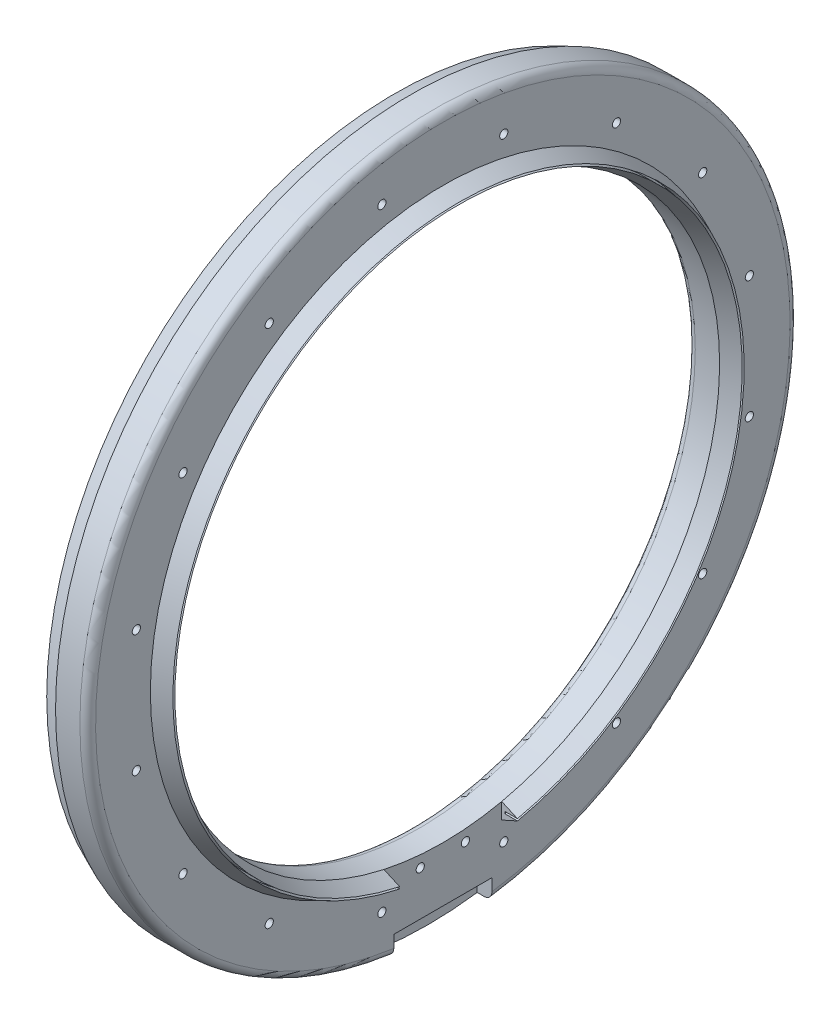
from build123d import *

# Parameters (mm, degrees)
CIRPATTERN4_COUNT               = 16
SKETCH11_W                      = 60
SKETCH11_H                      = 50
CUT_EXTRUDE1_DEPTH              = 10
FILLET4_R                       = 4
CUT_EXTRUDE3_DEPTH              = 25
CUT_EXTRUDE3_DEPTH_BACK         = 25
SKETCH20_W                      = 7.5
SKETCH20_H                      = 12
F_4_40_TAPPED_HOLE1_D           = 2.2606
F_4_40_TAPPED_HOLE1_DEPTH       = 7.6
F_4_40_TAPPED_HOLE1_CBORE_D     = 2.8448
F_4_40_TAPPED_HOLE1_CBORE_DEPTH = 5.69
F_4_40_TAPPED_HOLE1_TIP         = 0.679152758
SKETCH23_W                      = 30
SKETCH23_H                      = 10
BOSS_EXTRUDE2_DEPTH             = 7
SKETCH24_W                      = 30
SKETCH24_H                      = 10
BOSS_EXTRUDE3_DEPTH             = 10
M5X0_8_TAPPED_HOLE4_D           = 4.2
M5X0_8_TAPPED_HOLE4_DEPTH       = 9
M5X0_8_TAPPED_HOLE4_CBORE_D     = 5
M5X0_8_TAPPED_HOLE4_CBORE_DEPTH = 6.5
M5X0_8_TAPPED_HOLE4_TIP         = 1.2618073
SKETCH27_W                      = 2.1
SKETCH27_H                      = 24.4
LPATTERN1_COUNT                 = 2
LPATTERN1_PITCH                 = 23.0124
SKETCH29_W                      = 38.601366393
SKETCH29_H                      = 23.285158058
CUT_EXTRUDE5_DEPTH              = 257.99217901


with BuildPart() as part:
    # Sketch1 → Revolve1 (revolve)
    with BuildSketch(Plane.XY, mode=Mode.PRIVATE) as revolve1_sk:
        Polygon((-8.2, 180.9), (-16.2, 177.4), (-9.8, 177.4), (-9.8, 176.4), (-16.2, 176.4), (-8.2, 172.9), (-8.2, 141), (8.2, 141), (16.2, 144.5), (9.8, 144.5), (9.8, 145.5), (16.2, 145.5), (8.2, 149), (8.2, 180.9), align=None)
    revolve(revolve1_sk.sketch.rotate(Axis((-102.621263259, 0, 0), (1, 0, 0)), 90), axis=Axis((-102.621263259, 0, 0), (1, 0, 0)))

    # Sketch9 → M5x0.8 Tapped Hole2 (revolve, cut)
    with BuildSketch(Plane(origin=(-8.2, 156.14101664, -31.058379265), x_dir=(0, 0, 1), z_dir=(0, 1, 0))):
        Polygon((0, 0), (0, 21.2618073), (2.1, 20), (2.1, 0), align=None)
    m5x0_8_tapped_hole2 = revolve(axis=Axis((-14.55, 156.14101664, -31.058379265), (1, 0, 0)), mode=Mode.SUBTRACT)

    # CirPattern4: M5x0.8 Tapped Hole2 ×16 about axis
    cirpattern4_axis = Axis((0, 0, 0), (1, 0, 0))
    for i in range(1, CIRPATTERN4_COUNT):
        add(m5x0_8_tapped_hole2.rotate(cirpattern4_axis, i * 360 / CIRPATTERN4_COUNT), mode=Mode.SUBTRACT)

    # Sketch11 → Cut-Extrude1 (cut)
    with BuildSketch(Plane(origin=(8.2, 0, 0), x_dir=(0, 0, -1), z_dir=(1, 0, 0))):
        with Locations((0, -140.23)):
            Rectangle(SKETCH11_W, SKETCH11_H)
    extrude(amount=CUT_EXTRUDE1_DEPTH, mode=Mode.SUBTRACT)

    # Fillet4
    fillet4_edges = [part.edges().sort_by_distance(p)[0] for p in [
        (-8.2, 0, -141),
        (8.2, 0, -180.9),
    ]]
    fillet(fillet4_edges, radius=FILLET4_R)

    # Sketch20 → Cut-Extrude3 (cut, two sides: drawn at the far end of the back side and taken through both)
    with BuildSketch(Plane.XY.offset(-CUT_EXTRUDE3_DEPTH_BACK)):
        with Locations((4.45, -174.9)):
            Rectangle(SKETCH20_W, SKETCH20_H)
    extrude(amount=CUT_EXTRUDE3_DEPTH + CUT_EXTRUDE3_DEPTH_BACK, mode=Mode.SUBTRACT)

    # 4-40 Tapped Hole1
    with Locations(Plane(origin=(-8.2, -146.5, 0), x_dir=(0, 0, -1), z_dir=(-1, 0, 0))):
        with Locations((0, 0)):
            CounterBoreHole(F_4_40_TAPPED_HOLE1_D / 2, F_4_40_TAPPED_HOLE1_CBORE_D / 2, F_4_40_TAPPED_HOLE1_CBORE_DEPTH, depth=F_4_40_TAPPED_HOLE1_DEPTH)
            with Locations((0, 0, -(F_4_40_TAPPED_HOLE1_DEPTH + F_4_40_TAPPED_HOLE1_TIP / 2))):  # 118° drill point
                Cone(0, F_4_40_TAPPED_HOLE1_D / 2, F_4_40_TAPPED_HOLE1_TIP, mode=Mode.SUBTRACT)

    # Sketch23 → Boss-Extrude2 (add)
    with BuildSketch(Plane(origin=(8.2, 0, 0), x_dir=(0, 0, -1), z_dir=(1, 0, 0))):
        with Locations((0, -147)):
            Rectangle(SKETCH23_W, SKETCH23_H)
    extrude(amount=BOSS_EXTRUDE2_DEPTH)

    # Sketch24 → Boss-Extrude3 (add)
    with BuildSketch(Plane(origin=(21.56, 0, 0), x_dir=(0, 0, -1), z_dir=(1, 0, 0))):
        with Locations((0, -143.525)):
            Rectangle(SKETCH24_W, SKETCH24_H)
    extrude(amount=-BOSS_EXTRUDE3_DEPTH)

    # M5x0.8 Tapped Hole4
    with Locations(Plane(origin=(21.56, -143.525, 11.5), x_dir=(0, 0, 1), z_dir=(1, 0, 0))):
        with Locations((0, 0), (-23, 0)):
            CounterBoreHole(M5X0_8_TAPPED_HOLE4_D / 2, M5X0_8_TAPPED_HOLE4_CBORE_D / 2, M5X0_8_TAPPED_HOLE4_CBORE_DEPTH, depth=M5X0_8_TAPPED_HOLE4_DEPTH)
            with Locations((0, 0, -(M5X0_8_TAPPED_HOLE4_DEPTH + M5X0_8_TAPPED_HOLE4_TIP / 2))):  # 118° drill point
                Cone(0, M5X0_8_TAPPED_HOLE4_D / 2, M5X0_8_TAPPED_HOLE4_TIP, mode=Mode.SUBTRACT)

    # Sketch27 → M5x0.8 Tapped Hole5 (revolve, cut)
    with BuildSketch(Plane(origin=(8.2, -146.2786, 11.5062), x_dir=(0, 0, -1), z_dir=(0, 1, 0))):
        with Locations((1.05, 12.2)):
            Rectangle(SKETCH27_W, SKETCH27_H)
    m5x0_8_tapped_hole5 = revolve(axis=Axis((14.55, -146.2786, 11.5062), (-1, 0, 0)), mode=Mode.SUBTRACT)

    # LPattern1: M5x0.8 Tapped Hole5 ×2
    with Locations(*[(0, 0, -i * LPATTERN1_PITCH) for i in range(1, LPATTERN1_COUNT)]):
        add(m5x0_8_tapped_hole5, mode=Mode.SUBTRACT)

    # Sketch29 → Cut-Extrude5 (cut, through all)
    with BuildSketch(Plane(origin=(8.2, 0, 0), x_dir=(0, 0, -1), z_dir=(1, 0, 0))):
        with Locations((-0.206938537, -141.775345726)):
            Rectangle(SKETCH29_W, SKETCH29_H)
    extrude(amount=CUT_EXTRUDE5_DEPTH, mode=Mode.SUBTRACT)


solid = part.part
